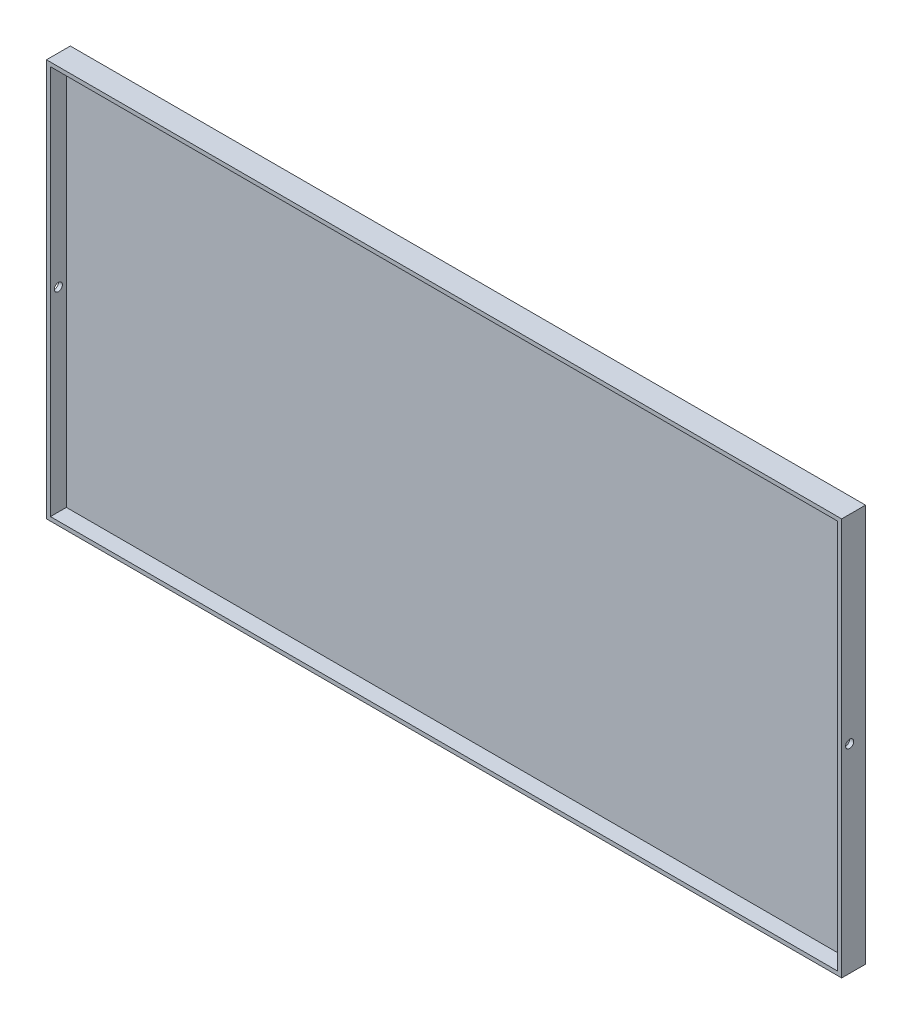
ISO-10303-21;
HEADER;
FILE_DESCRIPTION(('STEP AP214'),'2;1');
FILE_NAME('part.step','',(''),(''),'','','');
FILE_SCHEMA(('AUTOMOTIVE_DESIGN { 1 0 10303 214 1 1 1 1 }'));
ENDSEC;
DATA;
#1=APPLICATION_CONTEXT('core data for automotive mechanical design processes');
#2=APPLICATION_PROTOCOL_DEFINITION('international standard','automotive_design',2000,#1);
#3=PRODUCT_CONTEXT('',#1,'mechanical');
#4=PRODUCT('Part','Part','',(#3));
#5=PRODUCT_RELATED_PRODUCT_CATEGORY('part','',(#4));
#6=PRODUCT_DEFINITION_FORMATION('','',#4);
#7=PRODUCT_DEFINITION_CONTEXT('part definition',#1,'design');
#8=PRODUCT_DEFINITION('design','',#6,#7);
#9=PRODUCT_DEFINITION_SHAPE('','',#8);
#10=(LENGTH_UNIT() NAMED_UNIT(*) SI_UNIT(.MILLI.,.METRE.));
#11=(NAMED_UNIT(*) PLANE_ANGLE_UNIT() SI_UNIT($,.RADIAN.));
#12=(NAMED_UNIT(*) SI_UNIT($,.STERADIAN.) SOLID_ANGLE_UNIT());
#13=UNCERTAINTY_MEASURE_WITH_UNIT(LENGTH_MEASURE(1.E-05),#10,'distance_accuracy_value','');
#14=(GEOMETRIC_REPRESENTATION_CONTEXT(3) GLOBAL_UNCERTAINTY_ASSIGNED_CONTEXT((#13)) GLOBAL_UNIT_ASSIGNED_CONTEXT((#10,
#11,#12)) REPRESENTATION_CONTEXT('',''));
#15=CARTESIAN_POINT('',(0.,0.,0.));
#16=DIRECTION('',(0.,0.,1.));
#17=DIRECTION('',(1.,0.,0.));
#18=AXIS2_PLACEMENT_3D('',#15,#16,#17);
#19=CARTESIAN_POINT('',(500.,250.,20.));
#20=DIRECTION('',(-1.,0.,0.));
#21=DIRECTION('',(0.,-1.,0.));
#22=AXIS2_PLACEMENT_3D('',#19,#20,#21);
#23=PLANE('',#22);
#24=CARTESIAN_POINT('',(500.,1.11022302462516E-13,10.));
#25=DIRECTION('',(1.,0.,0.));
#26=DIRECTION('',(0.,1.,0.));
#27=AXIS2_PLACEMENT_3D('',#24,#25,#26);
#28=CIRCLE('',#27,5.08);
#29=CARTESIAN_POINT('',(500.,5.08000000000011,10.));
#30=VERTEX_POINT('',#29);
#31=EDGE_CURVE('E124',#30,#30,#28,.T.);
#32=ORIENTED_EDGE('',*,*,#31,.F.);
#33=EDGE_LOOP('',(#32));
#34=FACE_BOUND('',#33,.T.);
#35=DIRECTION('',(0.,0.,-1.));
#36=VECTOR('',#35,1.);
#37=CARTESIAN_POINT('',(500.,-250.,20.));
#38=LINE('',#37,#36);
#39=CARTESIAN_POINT('',(500.,-250.,20.));
#40=VERTEX_POINT('',#39);
#41=CARTESIAN_POINT('',(500.,-250.,-10.));
#42=VERTEX_POINT('',#41);
#43=EDGE_CURVE('E105',#40,#42,#38,.T.);
#44=ORIENTED_EDGE('',*,*,#43,.T.);
#45=DIRECTION('',(0.,1.,0.));
#46=VECTOR('',#45,1.);
#47=CARTESIAN_POINT('',(500.,250.,-10.));
#48=LINE('',#47,#46);
#49=CARTESIAN_POINT('',(500.,250.,-10.));
#50=VERTEX_POINT('',#49);
#51=EDGE_CURVE('E115',#42,#50,#48,.T.);
#52=ORIENTED_EDGE('',*,*,#51,.T.);
#53=DIRECTION('',(0.,0.,-1.));
#54=VECTOR('',#53,1.);
#55=CARTESIAN_POINT('',(500.,250.,20.));
#56=LINE('',#55,#54);
#57=CARTESIAN_POINT('',(500.,250.,20.));
#58=VERTEX_POINT('',#57);
#59=EDGE_CURVE('E11',#58,#50,#56,.T.);
#60=ORIENTED_EDGE('',*,*,#59,.F.);
#61=DIRECTION('',(0.,1.,0.));
#62=VECTOR('',#61,1.);
#63=CARTESIAN_POINT('',(500.,250.,20.));
#64=LINE('',#63,#62);
#65=EDGE_CURVE('E156',#40,#58,#64,.T.);
#66=ORIENTED_EDGE('',*,*,#65,.F.);
#67=EDGE_LOOP('',(#44,#52,#60,#66));
#68=FACE_BOUND('',#67,.T.);
#69=ADVANCED_FACE('F32',(#34,#68),#23,.F.);
#70=CARTESIAN_POINT('',(-500.,250.,20.));
#71=DIRECTION('',(0.,-1.,0.));
#72=DIRECTION('',(0.,0.,-1.));
#73=AXIS2_PLACEMENT_3D('',#70,#71,#72);
#74=PLANE('',#73);
#75=ORIENTED_EDGE('',*,*,#59,.T.);
#76=DIRECTION('',(-1.,0.,0.));
#77=VECTOR('',#76,1.);
#78=CARTESIAN_POINT('',(500.,250.,-10.));
#79=LINE('',#78,#77);
#80=CARTESIAN_POINT('',(-500.,250.,-10.));
#81=VERTEX_POINT('',#80);
#82=EDGE_CURVE('E122',#50,#81,#79,.T.);
#83=ORIENTED_EDGE('',*,*,#82,.T.);
#84=DIRECTION('',(0.,0.,-1.));
#85=VECTOR('',#84,1.);
#86=CARTESIAN_POINT('',(-500.,250.,20.));
#87=LINE('',#86,#85);
#88=CARTESIAN_POINT('',(-500.,250.,20.));
#89=VERTEX_POINT('',#88);
#90=EDGE_CURVE('E40',#89,#81,#87,.T.);
#91=ORIENTED_EDGE('',*,*,#90,.F.);
#92=DIRECTION('',(-1.,0.,0.));
#93=VECTOR('',#92,1.);
#94=CARTESIAN_POINT('',(-500.,250.,20.));
#95=LINE('',#94,#93);
#96=EDGE_CURVE('E163',#58,#89,#95,.T.);
#97=ORIENTED_EDGE('',*,*,#96,.F.);
#98=EDGE_LOOP('',(#75,#83,#91,#97));
#99=FACE_BOUND('',#98,.T.);
#100=ADVANCED_FACE('F192',(#99),#74,.F.);
#101=CARTESIAN_POINT('',(-500.,250.,20.));
#102=DIRECTION('',(1.,0.,0.));
#103=DIRECTION('',(0.,1.,0.));
#104=AXIS2_PLACEMENT_3D('',#101,#102,#103);
#105=PLANE('',#104);
#106=CARTESIAN_POINT('',(-500.,1.11022302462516E-13,10.));
#107=DIRECTION('',(-1.,0.,0.));
#108=DIRECTION('',(0.,-1.,0.));
#109=AXIS2_PLACEMENT_3D('',#106,#107,#108);
#110=CIRCLE('',#109,5.08);
#111=CARTESIAN_POINT('',(-500.,-5.07999999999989,10.));
#112=VERTEX_POINT('',#111);
#113=EDGE_CURVE('E127',#112,#112,#110,.T.);
#114=ORIENTED_EDGE('',*,*,#113,.F.);
#115=EDGE_LOOP('',(#114));
#116=FACE_BOUND('',#115,.T.);
#117=ORIENTED_EDGE('',*,*,#90,.T.);
#118=DIRECTION('',(0.,-1.,0.));
#119=VECTOR('',#118,1.);
#120=CARTESIAN_POINT('',(-500.,250.,-10.));
#121=LINE('',#120,#119);
#122=CARTESIAN_POINT('',(-500.,-250.,-10.));
#123=VERTEX_POINT('',#122);
#124=EDGE_CURVE('E112',#81,#123,#121,.T.);
#125=ORIENTED_EDGE('',*,*,#124,.T.);
#126=DIRECTION('',(0.,0.,-1.));
#127=VECTOR('',#126,1.);
#128=CARTESIAN_POINT('',(-500.,-250.,20.));
#129=LINE('',#128,#127);
#130=CARTESIAN_POINT('',(-500.,-250.,20.));
#131=VERTEX_POINT('',#130);
#132=EDGE_CURVE('E98',#131,#123,#129,.T.);
#133=ORIENTED_EDGE('',*,*,#132,.F.);
#134=DIRECTION('',(0.,-1.,0.));
#135=VECTOR('',#134,1.);
#136=CARTESIAN_POINT('',(-500.,250.,20.));
#137=LINE('',#136,#135);
#138=EDGE_CURVE('E165',#89,#131,#137,.T.);
#139=ORIENTED_EDGE('',*,*,#138,.F.);
#140=EDGE_LOOP('',(#117,#125,#133,#139));
#141=FACE_BOUND('',#140,.T.);
#142=ADVANCED_FACE('F117',(#116,#141),#105,.F.);
#143=CARTESIAN_POINT('',(-500.,-250.,20.));
#144=DIRECTION('',(0.,1.,0.));
#145=DIRECTION('',(0.,0.,1.));
#146=AXIS2_PLACEMENT_3D('',#143,#144,#145);
#147=PLANE('',#146);
#148=ORIENTED_EDGE('',*,*,#132,.T.);
#149=DIRECTION('',(1.,0.,0.));
#150=VECTOR('',#149,1.);
#151=CARTESIAN_POINT('',(500.,-250.,-10.));
#152=LINE('',#151,#150);
#153=EDGE_CURVE('E101',#123,#42,#152,.T.);
#154=ORIENTED_EDGE('',*,*,#153,.T.);
#155=ORIENTED_EDGE('',*,*,#43,.F.);
#156=DIRECTION('',(1.,0.,0.));
#157=VECTOR('',#156,1.);
#158=CARTESIAN_POINT('',(-500.,-250.,20.));
#159=LINE('',#158,#157);
#160=EDGE_CURVE('E56',#131,#40,#159,.T.);
#161=ORIENTED_EDGE('',*,*,#160,.F.);
#162=EDGE_LOOP('',(#148,#154,#155,#161));
#163=FACE_BOUND('',#162,.T.);
#164=ADVANCED_FACE('F100',(#163),#147,.F.);
#165=CARTESIAN_POINT('',(0.,0.,20.));
#166=DIRECTION('',(0.,0.,1.));
#167=DIRECTION('',(1.,0.,0.));
#168=AXIS2_PLACEMENT_3D('',#165,#166,#167);
#169=PLANE('',#168);
#170=DIRECTION('',(0.,1.,0.));
#171=VECTOR('',#170,1.);
#172=CARTESIAN_POINT('',(495.,245.,20.));
#173=LINE('',#172,#171);
#174=CARTESIAN_POINT('',(495.,-245.,20.));
#175=VERTEX_POINT('',#174);
#176=CARTESIAN_POINT('',(495.,245.,20.));
#177=VERTEX_POINT('',#176);
#178=EDGE_CURVE('E48',#175,#177,#173,.T.);
#179=ORIENTED_EDGE('',*,*,#178,.F.);
#180=DIRECTION('',(1.,0.,0.));
#181=VECTOR('',#180,1.);
#182=CARTESIAN_POINT('',(-495.,-245.,20.));
#183=LINE('',#182,#181);
#184=CARTESIAN_POINT('',(-495.,-245.,20.));
#185=VERTEX_POINT('',#184);
#186=EDGE_CURVE('E135',#185,#175,#183,.T.);
#187=ORIENTED_EDGE('',*,*,#186,.F.);
#188=DIRECTION('',(0.,-1.,0.));
#189=VECTOR('',#188,1.);
#190=CARTESIAN_POINT('',(-495.,245.,20.));
#191=LINE('',#190,#189);
#192=CARTESIAN_POINT('',(-495.,245.,20.));
#193=VERTEX_POINT('',#192);
#194=EDGE_CURVE('E149',#193,#185,#191,.T.);
#195=ORIENTED_EDGE('',*,*,#194,.F.);
#196=DIRECTION('',(-1.,0.,0.));
#197=VECTOR('',#196,1.);
#198=CARTESIAN_POINT('',(-495.,245.,20.));
#199=LINE('',#198,#197);
#200=EDGE_CURVE('E146',#177,#193,#199,.T.);
#201=ORIENTED_EDGE('',*,*,#200,.F.);
#202=EDGE_LOOP('',(#179,#187,#195,#201));
#203=FACE_BOUND('',#202,.T.);
#204=ORIENTED_EDGE('',*,*,#65,.T.);
#205=ORIENTED_EDGE('',*,*,#96,.T.);
#206=ORIENTED_EDGE('',*,*,#138,.T.);
#207=ORIENTED_EDGE('',*,*,#160,.T.);
#208=EDGE_LOOP('',(#204,#205,#206,#207));
#209=FACE_BOUND('',#208,.T.);
#210=ADVANCED_FACE('F202',(#203,#209),#169,.T.);
#211=CARTESIAN_POINT('',(495.,245.,0.));
#212=DIRECTION('',(1.,0.,0.));
#213=DIRECTION('',(0.,1.,0.));
#214=AXIS2_PLACEMENT_3D('',#211,#212,#213);
#215=PLANE('',#214);
#216=CARTESIAN_POINT('',(495.,1.09912079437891E-13,10.));
#217=DIRECTION('',(1.,0.,0.));
#218=DIRECTION('',(0.,1.,0.));
#219=AXIS2_PLACEMENT_3D('',#216,#217,#218);
#220=CIRCLE('',#219,5.08);
#221=CARTESIAN_POINT('',(495.,5.08000000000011,10.));
#222=VERTEX_POINT('',#221);
#223=EDGE_CURVE('E35',#222,#222,#220,.T.);
#224=ORIENTED_EDGE('',*,*,#223,.T.);
#225=EDGE_LOOP('',(#224));
#226=FACE_BOUND('',#225,.T.);
#227=ORIENTED_EDGE('',*,*,#178,.T.);
#228=DIRECTION('',(0.,0.,1.));
#229=VECTOR('',#228,1.);
#230=CARTESIAN_POINT('',(495.,245.,0.));
#231=LINE('',#230,#229);
#232=CARTESIAN_POINT('',(495.,245.,0.));
#233=VERTEX_POINT('',#232);
#234=EDGE_CURVE('E144',#233,#177,#231,.T.);
#235=ORIENTED_EDGE('',*,*,#234,.F.);
#236=DIRECTION('',(0.,1.,0.));
#237=VECTOR('',#236,1.);
#238=CARTESIAN_POINT('',(495.,245.,0.));
#239=LINE('',#238,#237);
#240=CARTESIAN_POINT('',(495.,-245.,0.));
#241=VERTEX_POINT('',#240);
#242=EDGE_CURVE('E131',#241,#233,#239,.T.);
#243=ORIENTED_EDGE('',*,*,#242,.F.);
#244=DIRECTION('',(0.,0.,1.));
#245=VECTOR('',#244,1.);
#246=CARTESIAN_POINT('',(495.,-245.,0.));
#247=LINE('',#246,#245);
#248=EDGE_CURVE('E154',#241,#175,#247,.T.);
#249=ORIENTED_EDGE('',*,*,#248,.T.);
#250=EDGE_LOOP('',(#227,#235,#243,#249));
#251=FACE_BOUND('',#250,.T.);
#252=ADVANCED_FACE('F204',(#226,#251),#215,.F.);
#253=CARTESIAN_POINT('',(-495.,-245.,0.));
#254=DIRECTION('',(0.,-1.,0.));
#255=DIRECTION('',(0.,0.,-1.));
#256=AXIS2_PLACEMENT_3D('',#253,#254,#255);
#257=PLANE('',#256);
#258=ORIENTED_EDGE('',*,*,#186,.T.);
#259=ORIENTED_EDGE('',*,*,#248,.F.);
#260=DIRECTION('',(1.,0.,0.));
#261=VECTOR('',#260,1.);
#262=CARTESIAN_POINT('',(-495.,-245.,0.));
#263=LINE('',#262,#261);
#264=CARTESIAN_POINT('',(-495.,-245.,0.));
#265=VERTEX_POINT('',#264);
#266=EDGE_CURVE('E141',#265,#241,#263,.T.);
#267=ORIENTED_EDGE('',*,*,#266,.F.);
#268=DIRECTION('',(0.,0.,1.));
#269=VECTOR('',#268,1.);
#270=CARTESIAN_POINT('',(-495.,-245.,0.));
#271=LINE('',#270,#269);
#272=EDGE_CURVE('E157',#265,#185,#271,.T.);
#273=ORIENTED_EDGE('',*,*,#272,.T.);
#274=EDGE_LOOP('',(#258,#259,#267,#273));
#275=FACE_BOUND('',#274,.T.);
#276=ADVANCED_FACE('F211',(#275),#257,.F.);
#277=CARTESIAN_POINT('',(-495.,245.,0.));
#278=DIRECTION('',(-1.,0.,0.));
#279=DIRECTION('',(0.,-1.,0.));
#280=AXIS2_PLACEMENT_3D('',#277,#278,#279);
#281=PLANE('',#280);
#282=CARTESIAN_POINT('',(-495.,1.12132525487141E-13,10.));
#283=DIRECTION('',(-1.,0.,0.));
#284=DIRECTION('',(0.,-1.,0.));
#285=AXIS2_PLACEMENT_3D('',#282,#283,#284);
#286=CIRCLE('',#285,5.08);
#287=CARTESIAN_POINT('',(-495.,-5.07999999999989,10.));
#288=VERTEX_POINT('',#287);
#289=EDGE_CURVE('E130',#288,#288,#286,.T.);
#290=ORIENTED_EDGE('',*,*,#289,.T.);
#291=EDGE_LOOP('',(#290));
#292=FACE_BOUND('',#291,.T.);
#293=ORIENTED_EDGE('',*,*,#194,.T.);
#294=ORIENTED_EDGE('',*,*,#272,.F.);
#295=DIRECTION('',(0.,-1.,0.));
#296=VECTOR('',#295,1.);
#297=CARTESIAN_POINT('',(-495.,245.,0.));
#298=LINE('',#297,#296);
#299=CARTESIAN_POINT('',(-495.,245.,0.));
#300=VERTEX_POINT('',#299);
#301=EDGE_CURVE('E138',#300,#265,#298,.T.);
#302=ORIENTED_EDGE('',*,*,#301,.F.);
#303=DIRECTION('',(0.,0.,1.));
#304=VECTOR('',#303,1.);
#305=CARTESIAN_POINT('',(-495.,245.,0.));
#306=LINE('',#305,#304);
#307=EDGE_CURVE('E159',#300,#193,#306,.T.);
#308=ORIENTED_EDGE('',*,*,#307,.T.);
#309=EDGE_LOOP('',(#293,#294,#302,#308));
#310=FACE_BOUND('',#309,.T.);
#311=ADVANCED_FACE('F172',(#292,#310),#281,.F.);
#312=CARTESIAN_POINT('',(-495.,245.,0.));
#313=DIRECTION('',(0.,1.,0.));
#314=DIRECTION('',(0.,0.,1.));
#315=AXIS2_PLACEMENT_3D('',#312,#313,#314);
#316=PLANE('',#315);
#317=ORIENTED_EDGE('',*,*,#200,.T.);
#318=ORIENTED_EDGE('',*,*,#307,.F.);
#319=DIRECTION('',(-1.,0.,0.));
#320=VECTOR('',#319,1.);
#321=CARTESIAN_POINT('',(-495.,245.,0.));
#322=LINE('',#321,#320);
#323=EDGE_CURVE('E134',#233,#300,#322,.T.);
#324=ORIENTED_EDGE('',*,*,#323,.F.);
#325=ORIENTED_EDGE('',*,*,#234,.T.);
#326=EDGE_LOOP('',(#317,#318,#324,#325));
#327=FACE_BOUND('',#326,.T.);
#328=ADVANCED_FACE('F178',(#327),#316,.F.);
#329=CARTESIAN_POINT('',(-490.,1.13242748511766E-13,10.));
#330=DIRECTION('',(-1.,0.,0.));
#331=DIRECTION('',(0.,-1.,0.));
#332=AXIS2_PLACEMENT_3D('',#329,#330,#331);
#333=CYLINDRICAL_SURFACE('',#332,5.08);
#334=ORIENTED_EDGE('',*,*,#113,.T.);
#335=EDGE_LOOP('',(#334));
#336=FACE_BOUND('',#335,.T.);
#337=ORIENTED_EDGE('',*,*,#289,.F.);
#338=EDGE_LOOP('',(#337));
#339=FACE_BOUND('',#338,.T.);
#340=ADVANCED_FACE('F175',(#336,#339),#333,.F.);
#341=CARTESIAN_POINT('',(490.,1.08801856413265E-13,10.));
#342=DIRECTION('',(1.,0.,0.));
#343=DIRECTION('',(0.,1.,0.));
#344=AXIS2_PLACEMENT_3D('',#341,#342,#343);
#345=CYLINDRICAL_SURFACE('',#344,5.08);
#346=ORIENTED_EDGE('',*,*,#31,.T.);
#347=EDGE_LOOP('',(#346));
#348=FACE_BOUND('',#347,.T.);
#349=ORIENTED_EDGE('',*,*,#223,.F.);
#350=EDGE_LOOP('',(#349));
#351=FACE_BOUND('',#350,.T.);
#352=ADVANCED_FACE('F177',(#348,#351),#345,.F.);
#353=CARTESIAN_POINT('',(0.,0.,0.));
#354=DIRECTION('',(0.,0.,-1.));
#355=DIRECTION('',(-1.,0.,0.));
#356=AXIS2_PLACEMENT_3D('',#353,#354,#355);
#357=PLANE('',#356);
#358=ORIENTED_EDGE('',*,*,#266,.T.);
#359=ORIENTED_EDGE('',*,*,#242,.T.);
#360=ORIENTED_EDGE('',*,*,#323,.T.);
#361=ORIENTED_EDGE('',*,*,#301,.T.);
#362=EDGE_LOOP('',(#358,#359,#360,#361));
#363=FACE_BOUND('',#362,.T.);
#364=ADVANCED_FACE('F185',(#363),#357,.F.);
#365=CARTESIAN_POINT('',(0.,0.,-10.));
#366=DIRECTION('',(0.,0.,-1.));
#367=DIRECTION('',(-1.,0.,0.));
#368=AXIS2_PLACEMENT_3D('',#365,#366,#367);
#369=PLANE('',#368);
#370=ORIENTED_EDGE('',*,*,#124,.F.);
#371=ORIENTED_EDGE('',*,*,#82,.F.);
#372=ORIENTED_EDGE('',*,*,#51,.F.);
#373=ORIENTED_EDGE('',*,*,#153,.F.);
#374=EDGE_LOOP('',(#370,#371,#372,#373));
#375=FACE_BOUND('',#374,.T.);
#376=ADVANCED_FACE('F110',(#375),#369,.T.);
#377=CLOSED_SHELL('',(#69,#100,#142,#164,#210,#252,#276,#311,#328,#340,#352,#364,#376));
#378=MANIFOLD_SOLID_BREP('B2',#377);
#379=ADVANCED_BREP_SHAPE_REPRESENTATION('',(#18,#378),#14);
#380=SHAPE_DEFINITION_REPRESENTATION(#9,#379);
ENDSEC;
END-ISO-10303-21;
